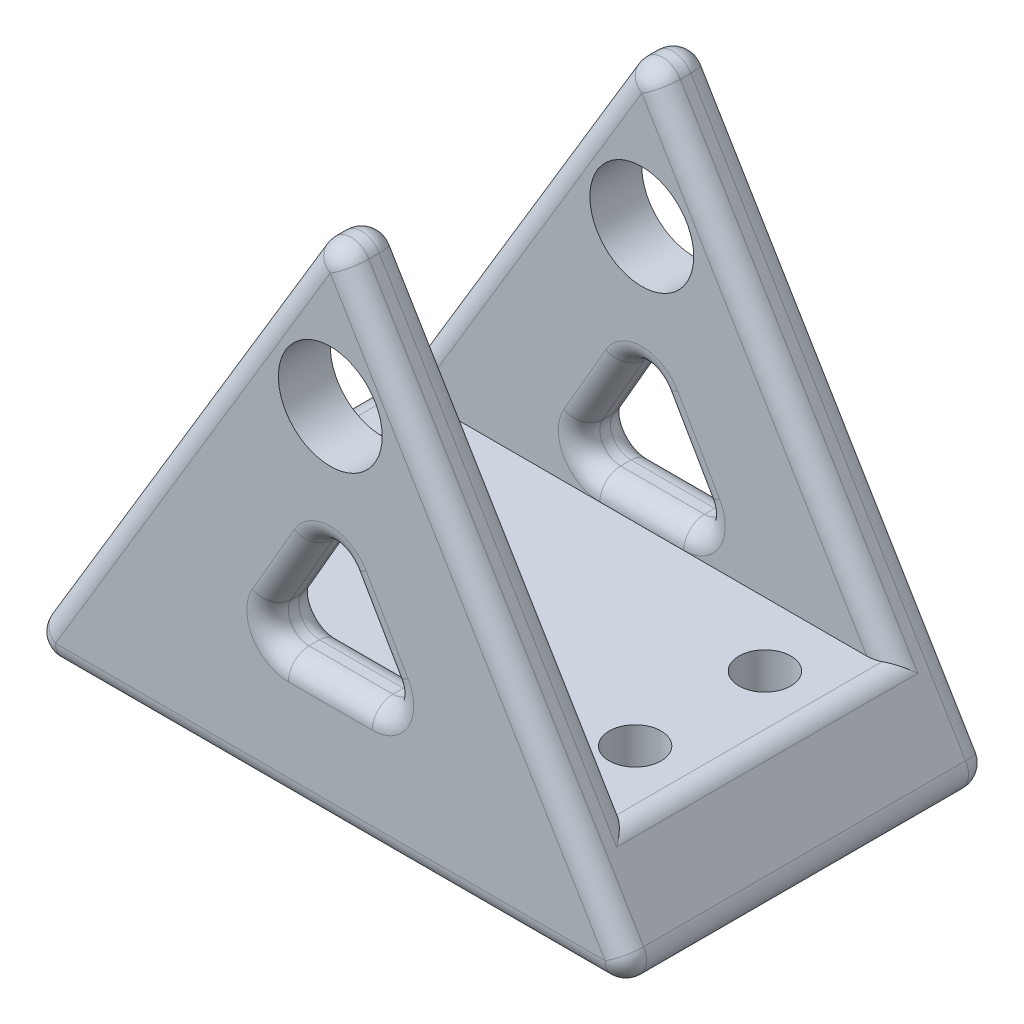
from build123d import *

# Parameters (mm, degrees)
SKETCH2_W           = 76.2
SKETCH2_H           = 63.5
BOSS_EXTRUDE1_DEPTH = 44.45
SKETCH5_W           = 31.75
SKETCH5_H           = 50.8
CUT_EXTRUDE3_DEPTH  = 94.756626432
CUT_EXTRUDE4_DEPTH  = 44.45
CUT_EXTRUDE5_DEPTH  = 67.599361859
SKETCH7_R           = 3.175
CUT_EXTRUDE6_DEPTH  = 44.45
SKETCH8_R           = 6.35
CUT_EXTRUDE7_DEPTH  = 67.599361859
FILLET1_R           = 2.54


with BuildPart() as part:
    # Sketch2 → Boss-Extrude1 (new body)
    with BuildSketch(Plane.XY):
        Rectangle(SKETCH2_W, SKETCH2_H)
    extrude(amount=BOSS_EXTRUDE1_DEPTH)

    # Sketch5 → Cut-Extrude3 (cut, through all)
    with BuildSketch(Plane(origin=(38.1, 0, 0), x_dir=(0, 0, -1), z_dir=(1, 0, 0))):
        with Locations((-22.225, 6.35)):
            Rectangle(SKETCH5_W, SKETCH5_H)
    extrude(amount=-CUT_EXTRUDE3_DEPTH, mode=Mode.SUBTRACT)

    # Sketch3 → Cut-Extrude4 (cut)
    with BuildSketch(Plane.XY.offset(44.45)):
        Polygon((-38.1, -31.75), (0, 31.75), (-38.1, 31.75), align=None)
    extrude(amount=-CUT_EXTRUDE4_DEPTH, mode=Mode.SUBTRACT)

    # Sketch6 → Cut-Extrude5 (cut, through all)
    with BuildSketch(Plane.XY.offset(44.45)):
        Polygon((0, 31.75), (38.1, -31.75), (38.1, 31.75), align=None)
    extrude(amount=-CUT_EXTRUDE5_DEPTH, mode=Mode.SUBTRACT)

    # Sketch7 → Cut-Extrude6 (cut)
    with BuildSketch(Plane(origin=(0, -19.05, 0), x_dir=(1, 0, 0), z_dir=(0, 1, 0))):
        with Locations(Location((-22.86, -14.149533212, 0), (0, 0, 180))):
            Circle(SKETCH7_R)
        with Locations(Location((22.86, -14.149533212, 0), (0, 0, 270))):
            Circle(SKETCH7_R)
        with Locations(Location((22.86, -30.024533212, 0), (0, 0, 180))):
            Circle(SKETCH7_R)
        with Locations(Location((-22.86, -30.024533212, 0), (0, 0, 270))):
            Circle(SKETCH7_R)
    extrude(amount=-CUT_EXTRUDE6_DEPTH, mode=Mode.SUBTRACT)

    # Sketch8 → Cut-Extrude7 (cut, through all)
    with BuildSketch(Plane.XY.offset(44.45)):
        with Locations((0, 12.7)):
            Circle(SKETCH8_R)
        Polygon((0, 0), (-9.525, -16.497783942), (9.525, -16.497783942), align=None)
    extrude(amount=-CUT_EXTRUDE7_DEPTH, mode=Mode.SUBTRACT)

    # Fillet1
    fillet1_edges = [part.edges().sort_by_distance(p)[0] for p in [
        (0, -31.75, 44.45),
        (-15.24, 6.35, 38.1),
        (0, 31.75, 3.175),
        (-15.24, 6.35, 6.35),
        (-30.48, -19.05, 22.225),
        (0, 31.75, 41.275),
        (-19.05, 0, 0),
        (-19.05, 0, 44.45),
        (0, -31.75, 0),
        (30.48, -19.05, 22.225),
        (15.24, 6.35, 6.35),
        (19.05, 0, 0),
        (15.24, 6.35, 38.1),
        (19.05, 0, 44.45),
        (38.1, -31.75, 22.225),
        (-38.1, -31.75, 22.225),
        (-4.7625, -8.248891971, 38.1),
        (0, -16.497783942, 38.1),
        (4.7625, -8.248891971, 38.1),
        (0, 0, 3.175),
        (4.7625, -8.248891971, 6.35),
        (4.7625, -8.248891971, 0),
        (0, 0, 41.275),
        (9.525, -16.497783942, 3.175),
        (0, -16.497783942, 6.35),
        (0, -16.497783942, 0),
        (9.525, -16.497783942, 41.275),
        (-9.525, -16.497783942, 3.175),
        (-4.7625, -8.248891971, 6.35),
        (-4.7625, -8.248891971, 0),
        (-9.525, -16.497783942, 41.275),
        (4.7625, -8.248891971, 44.45),
        (-4.7625, -8.248891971, 44.45),
        (0, -16.497783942, 44.45),
    ]]
    fillet(fillet1_edges, radius=FILLET1_R)


solid = part.part
